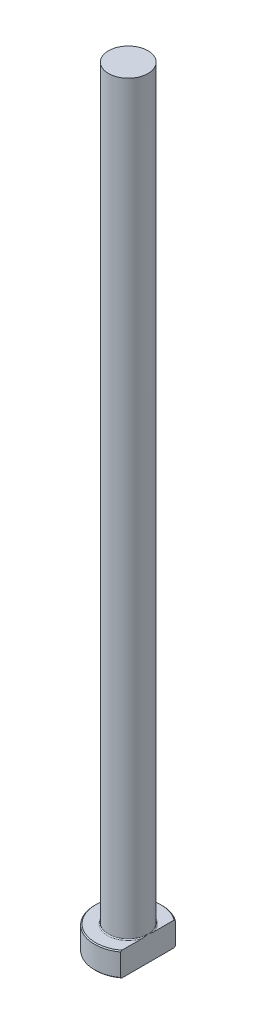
from build123d import *
from build123d.topology import SkipClean

# Parameters (mm, degrees)
CHAMFER1_SIZE = 0.2
FILLET1_R     = 0.2
KEY_DEPTH     = 161.305957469


with BuildPart() as part:
    # Sketch1 → Revolve1 (revolve)
    with BuildSketch(Plane.XY, mode=Mode.PRIVATE) as revolve1_sk:
        Polygon((0, 0), (-7, 0), (-7, 5), (-4.1, 5), (-4.1, 160), (0, 160), align=None)
    revolve(revolve1_sk.sketch.rotate(Axis((0, 259.958771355, 0), (0, -1, 0)), 270), axis=Axis((0, 259.958771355, 0), (0, -1, 0)))

    # Chamfer1
    chamfer1_edges = [part.edges().sort_by_distance(p)[0] for p in [
        (0, 5, -7),
        (0, 0, -7),
    ]]
    chamfer(chamfer1_edges, length=CHAMFER1_SIZE)

    # Fillet1
    fillet1_edges = [part.edges().sort_by_distance(p)[0] for p in [
        (0, 5, -4.1),
    ]]
    fillet(fillet1_edges, radius=FILLET1_R)

    # Sketch2 → KEY (cut, through all)
    with SkipClean():  # the faces are left unmerged after this step: merging them gives an invalid solid
        with BuildSketch(Plane(origin=(0, 0, 0), x_dir=(1, 0, 0), z_dir=(0, 1, 0))):
            with BuildLine():
                Line((4.1, 5.673623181), (4.1, -5.673623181))
                ThreePointArc((4.1, -5.673623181), (7, 0), (4.1, 5.673623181))
            make_face()
        extrude(amount=KEY_DEPTH, mode=Mode.SUBTRACT)


solid = part.part
